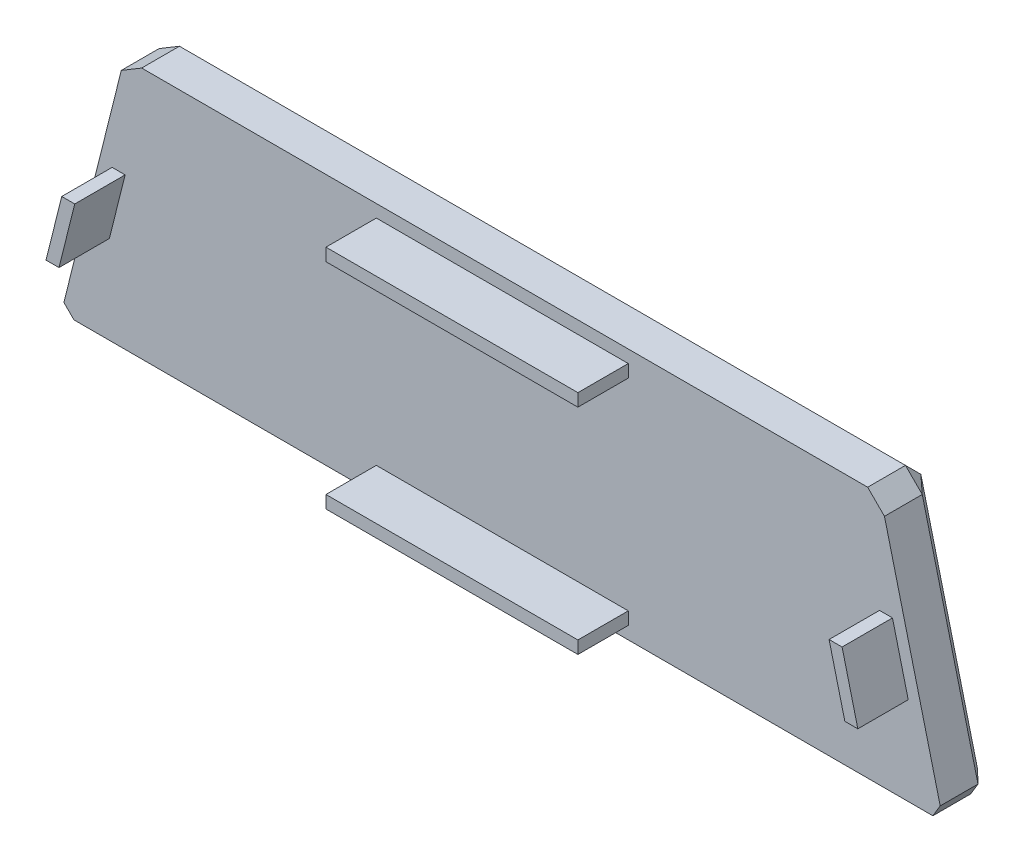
ISO-10303-21;
HEADER;
FILE_DESCRIPTION(('STEP AP214'),'2;1');
FILE_NAME('part.step','',(''),(''),'','','');
FILE_SCHEMA(('AUTOMOTIVE_DESIGN { 1 0 10303 214 1 1 1 1 }'));
ENDSEC;
DATA;
#1=APPLICATION_CONTEXT('core data for automotive mechanical design processes');
#2=APPLICATION_PROTOCOL_DEFINITION('international standard','automotive_design',2000,#1);
#3=PRODUCT_CONTEXT('',#1,'mechanical');
#4=PRODUCT('Part','Part','',(#3));
#5=PRODUCT_RELATED_PRODUCT_CATEGORY('part','',(#4));
#6=PRODUCT_DEFINITION_FORMATION('','',#4);
#7=PRODUCT_DEFINITION_CONTEXT('part definition',#1,'design');
#8=PRODUCT_DEFINITION('design','',#6,#7);
#9=PRODUCT_DEFINITION_SHAPE('','',#8);
#10=(LENGTH_UNIT() NAMED_UNIT(*) SI_UNIT(.MILLI.,.METRE.));
#11=(NAMED_UNIT(*) PLANE_ANGLE_UNIT() SI_UNIT($,.RADIAN.));
#12=(NAMED_UNIT(*) SI_UNIT($,.STERADIAN.) SOLID_ANGLE_UNIT());
#13=UNCERTAINTY_MEASURE_WITH_UNIT(LENGTH_MEASURE(1.E-05),#10,'distance_accuracy_value','');
#14=(GEOMETRIC_REPRESENTATION_CONTEXT(3) GLOBAL_UNCERTAINTY_ASSIGNED_CONTEXT((#13)) GLOBAL_UNIT_ASSIGNED_CONTEXT((#10,
#11,#12)) REPRESENTATION_CONTEXT('',''));
#15=CARTESIAN_POINT('',(0.,0.,0.));
#16=DIRECTION('',(0.,0.,1.));
#17=DIRECTION('',(1.,0.,0.));
#18=AXIS2_PLACEMENT_3D('',#15,#16,#17);
#19=CARTESIAN_POINT('',(0.,0.,0.));
#20=DIRECTION('',(0.,0.,1.));
#21=DIRECTION('',(1.,0.,0.));
#22=AXIS2_PLACEMENT_3D('',#19,#20,#21);
#23=PLANE('',#22);
#24=DIRECTION('',(-1.,0.,0.));
#25=VECTOR('',#24,1.);
#26=CARTESIAN_POINT('',(0.,11.,0.));
#27=LINE('',#26,#25);
#28=CARTESIAN_POINT('',(16.1096117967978,11.,0.));
#29=VERTEX_POINT('',#28);
#30=CARTESIAN_POINT('',(15.5942235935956,11.,0.));
#31=VERTEX_POINT('',#30);
#32=EDGE_CURVE('E219',#29,#31,#27,.T.);
#33=ORIENTED_EDGE('',*,*,#32,.T.);
#34=DIRECTION('',(-0.242535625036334,0.970142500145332,0.));
#35=VECTOR('',#34,1.);
#36=CARTESIAN_POINT('',(17.2651516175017,4.31628790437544,0.));
#37=LINE('',#36,#35);
#38=CARTESIAN_POINT('',(14.9692235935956,13.5,0.));
#39=VERTEX_POINT('',#38);
#40=EDGE_CURVE('E236',#31,#39,#37,.T.);
#41=ORIENTED_EDGE('',*,*,#40,.T.);
#42=DIRECTION('',(-1.,0.,0.));
#43=VECTOR('',#42,1.);
#44=CARTESIAN_POINT('',(0.,13.5,0.));
#45=LINE('',#44,#43);
#46=CARTESIAN_POINT('',(15.4846117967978,13.5,0.));
#47=VERTEX_POINT('',#46);
#48=EDGE_CURVE('E238',#47,#39,#45,.T.);
#49=ORIENTED_EDGE('',*,*,#48,.F.);
#50=DIRECTION('',(-0.242535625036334,0.970142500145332,0.));
#51=VECTOR('',#50,1.);
#52=CARTESIAN_POINT('',(17.7502228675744,4.43755571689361,0.));
#53=LINE('',#52,#51);
#54=EDGE_CURVE('E245',#29,#47,#53,.T.);
#55=ORIENTED_EDGE('',*,*,#54,.F.);
#56=EDGE_LOOP('',(#33,#41,#49,#55));
#57=FACE_BOUND('',#56,.T.);
#58=DIRECTION('',(0.242535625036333,-0.970142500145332,0.));
#59=VECTOR('',#58,1.);
#60=CARTESIAN_POINT('',(18.2352941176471,4.55882352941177,0.));
#61=LINE('',#60,#59);
#62=CARTESIAN_POINT('',(15.1666666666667,16.8333333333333,0.));
#63=VERTEX_POINT('',#62);
#64=CARTESIAN_POINT('',(17.3787321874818,7.98507125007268,0.));
#65=VERTEX_POINT('',#64);
#66=EDGE_CURVE('E350',#63,#65,#61,.T.);
#67=ORIENTED_EDGE('',*,*,#66,.F.);
#68=DIRECTION('',(0.707106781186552,-0.707106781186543,0.));
#69=VECTOR('',#68,1.);
#70=CARTESIAN_POINT('',(15.9999999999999,16.0000000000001,0.));
#71=LINE('',#70,#69);
#72=CARTESIAN_POINT('',(14.5,17.5,0.));
#73=VERTEX_POINT('',#72);
#74=EDGE_CURVE('E11',#63,#73,#71,.F.);
#75=ORIENTED_EDGE('',*,*,#74,.T.);
#76=DIRECTION('',(1.,0.,0.));
#77=VECTOR('',#76,1.);
#78=CARTESIAN_POINT('',(0.,17.5,0.));
#79=LINE('',#78,#77);
#80=CARTESIAN_POINT('',(-14.3128157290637,17.5,0.));
#81=VERTEX_POINT('',#80);
#82=EDGE_CURVE('E353',#81,#73,#79,.T.);
#83=ORIENTED_EDGE('',*,*,#82,.F.);
#84=DIRECTION('',(0.857492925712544,0.514495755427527,0.));
#85=VECTOR('',#84,1.);
#86=CARTESIAN_POINT('',(-11.509274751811,19.1821245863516,0.));
#87=LINE('',#86,#85);
#88=CARTESIAN_POINT('',(-15.1212678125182,17.0149287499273,0.));
#89=VERTEX_POINT('',#88);
#90=EDGE_CURVE('E388',#81,#89,#87,.F.);
#91=ORIENTED_EDGE('',*,*,#90,.T.);
#92=DIRECTION('',(0.242535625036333,0.970142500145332,0.));
#93=VECTOR('',#92,1.);
#94=CARTESIAN_POINT('',(-18.2352941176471,4.55882352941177,0.));
#95=LINE('',#94,#93);
#96=CARTESIAN_POINT('',(-17.4,7.89999999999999,0.));
#97=VERTEX_POINT('',#96);
#98=EDGE_CURVE('E345',#97,#89,#95,.T.);
#99=ORIENTED_EDGE('',*,*,#98,.F.);
#100=DIRECTION('',(0.707106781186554,-0.707106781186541,0.));
#101=VECTOR('',#100,1.);
#102=CARTESIAN_POINT('',(-4.74999999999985,-4.74999999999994,0.));
#103=LINE('',#102,#101);
#104=CARTESIAN_POINT('',(-17.,7.5,0.));
#105=VERTEX_POINT('',#104);
#106=EDGE_CURVE('E390',#97,#105,#103,.T.);
#107=ORIENTED_EDGE('',*,*,#106,.T.);
#108=DIRECTION('',(1.,0.,0.));
#109=VECTOR('',#108,1.);
#110=CARTESIAN_POINT('',(0.,7.5,0.));
#111=LINE('',#110,#109);
#112=CARTESIAN_POINT('',(17.0876894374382,7.5,0.));
#113=VERTEX_POINT('',#112);
#114=EDGE_CURVE('E347',#105,#113,#111,.T.);
#115=ORIENTED_EDGE('',*,*,#114,.T.);
#116=DIRECTION('',(0.514495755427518,0.85749292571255,0.));
#117=VECTOR('',#116,1.);
#118=CARTESIAN_POINT('',(9.25565399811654,-5.55339239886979,0.));
#119=LINE('',#118,#117);
#120=EDGE_CURVE('E46',#113,#65,#119,.T.);
#121=ORIENTED_EDGE('',*,*,#120,.T.);
#122=EDGE_LOOP('',(#67,#75,#83,#91,#99,#107,#115,#121));
#123=FACE_BOUND('',#122,.T.);
#124=DIRECTION('',(1.,0.,0.));
#125=VECTOR('',#124,1.);
#126=CARTESIAN_POINT('',(0.,13.5,0.));
#127=LINE('',#126,#125);
#128=CARTESIAN_POINT('',(-15.4846117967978,13.5,0.));
#129=VERTEX_POINT('',#128);
#130=CARTESIAN_POINT('',(-14.9692235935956,13.5,0.));
#131=VERTEX_POINT('',#130);
#132=EDGE_CURVE('E313',#129,#131,#127,.T.);
#133=ORIENTED_EDGE('',*,*,#132,.T.);
#134=DIRECTION('',(-0.242535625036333,-0.970142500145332,0.));
#135=VECTOR('',#134,1.);
#136=CARTESIAN_POINT('',(-17.2651516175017,4.31628790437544,0.));
#137=LINE('',#136,#135);
#138=CARTESIAN_POINT('',(-15.5942235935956,11.,0.));
#139=VERTEX_POINT('',#138);
#140=EDGE_CURVE('E318',#131,#139,#137,.T.);
#141=ORIENTED_EDGE('',*,*,#140,.T.);
#142=DIRECTION('',(1.,0.,0.));
#143=VECTOR('',#142,1.);
#144=CARTESIAN_POINT('',(0.,11.,0.));
#145=LINE('',#144,#143);
#146=CARTESIAN_POINT('',(-16.1096117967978,11.,0.));
#147=VERTEX_POINT('',#146);
#148=EDGE_CURVE('E330',#147,#139,#145,.T.);
#149=ORIENTED_EDGE('',*,*,#148,.F.);
#150=DIRECTION('',(-0.242535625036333,-0.970142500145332,0.));
#151=VECTOR('',#150,1.);
#152=CARTESIAN_POINT('',(-17.7502228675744,4.4375557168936,0.));
#153=LINE('',#152,#151);
#154=EDGE_CURVE('E327',#129,#147,#153,.T.);
#155=ORIENTED_EDGE('',*,*,#154,.F.);
#156=EDGE_LOOP('',(#133,#141,#149,#155));
#157=FACE_BOUND('',#156,.T.);
#158=DIRECTION('',(-1.,0.,0.));
#159=VECTOR('',#158,1.);
#160=CARTESIAN_POINT('',(0.,16.5,0.));
#161=LINE('',#160,#159);
#162=CARTESIAN_POINT('',(5.,16.5,0.));
#163=VERTEX_POINT('',#162);
#164=CARTESIAN_POINT('',(-5.,16.5,0.));
#165=VERTEX_POINT('',#164);
#166=EDGE_CURVE('E284',#163,#165,#161,.T.);
#167=ORIENTED_EDGE('',*,*,#166,.T.);
#168=DIRECTION('',(0.,-1.,0.));
#169=VECTOR('',#168,1.);
#170=CARTESIAN_POINT('',(-5.,0.,0.));
#171=LINE('',#170,#169);
#172=CARTESIAN_POINT('',(-5.,17.,0.));
#173=VERTEX_POINT('',#172);
#174=EDGE_CURVE('E289',#173,#165,#171,.T.);
#175=ORIENTED_EDGE('',*,*,#174,.F.);
#176=DIRECTION('',(-1.,0.,0.));
#177=VECTOR('',#176,1.);
#178=CARTESIAN_POINT('',(0.,17.,0.));
#179=LINE('',#178,#177);
#180=CARTESIAN_POINT('',(5.,17.,0.));
#181=VERTEX_POINT('',#180);
#182=EDGE_CURVE('E300',#181,#173,#179,.T.);
#183=ORIENTED_EDGE('',*,*,#182,.F.);
#184=DIRECTION('',(0.,1.,0.));
#185=VECTOR('',#184,1.);
#186=CARTESIAN_POINT('',(5.,0.,0.));
#187=LINE('',#186,#185);
#188=EDGE_CURVE('E298',#163,#181,#187,.T.);
#189=ORIENTED_EDGE('',*,*,#188,.F.);
#190=EDGE_LOOP('',(#167,#175,#183,#189));
#191=FACE_BOUND('',#190,.T.);
#192=DIRECTION('',(0.,1.,0.));
#193=VECTOR('',#192,1.);
#194=CARTESIAN_POINT('',(5.,0.,0.));
#195=LINE('',#194,#193);
#196=CARTESIAN_POINT('',(5.,8.,0.));
#197=VERTEX_POINT('',#196);
#198=CARTESIAN_POINT('',(5.,8.5,0.));
#199=VERTEX_POINT('',#198);
#200=EDGE_CURVE('E268',#197,#199,#195,.T.);
#201=ORIENTED_EDGE('',*,*,#200,.F.);
#202=DIRECTION('',(1.,0.,0.));
#203=VECTOR('',#202,1.);
#204=CARTESIAN_POINT('',(0.,8.,0.));
#205=LINE('',#204,#203);
#206=CARTESIAN_POINT('',(-5.,8.,0.));
#207=VERTEX_POINT('',#206);
#208=EDGE_CURVE('E222',#207,#197,#205,.T.);
#209=ORIENTED_EDGE('',*,*,#208,.F.);
#210=DIRECTION('',(0.,-1.,0.));
#211=VECTOR('',#210,1.);
#212=CARTESIAN_POINT('',(-5.,0.,0.));
#213=LINE('',#212,#211);
#214=CARTESIAN_POINT('',(-5.,8.5,0.));
#215=VERTEX_POINT('',#214);
#216=EDGE_CURVE('E258',#215,#207,#213,.T.);
#217=ORIENTED_EDGE('',*,*,#216,.F.);
#218=DIRECTION('',(1.,0.,0.));
#219=VECTOR('',#218,1.);
#220=CARTESIAN_POINT('',(0.,8.5,0.));
#221=LINE('',#220,#219);
#222=EDGE_CURVE('E271',#215,#199,#221,.T.);
#223=ORIENTED_EDGE('',*,*,#222,.T.);
#224=EDGE_LOOP('',(#201,#209,#217,#223));
#225=FACE_BOUND('',#224,.T.);
#226=ADVANCED_FACE('F37',(#57,#123,#157,#191,#225),#23,.T.);
#227=CARTESIAN_POINT('',(-18.2352941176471,4.55882352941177,-2.));
#228=DIRECTION('',(0.970142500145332,-0.242535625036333,0.));
#229=DIRECTION('',(0.242535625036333,0.970142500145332,0.));
#230=AXIS2_PLACEMENT_3D('',#227,#228,#229);
#231=PLANE('',#230);
#232=DIRECTION('',(-0.242535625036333,-0.970142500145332,0.));
#233=VECTOR('',#232,1.);
#234=CARTESIAN_POINT('',(-18.2352941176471,4.55882352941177,-1.5));
#235=LINE('',#234,#233);
#236=CARTESIAN_POINT('',(-15.1212678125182,17.0149287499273,-1.5));
#237=VERTEX_POINT('',#236);
#238=CARTESIAN_POINT('',(-17.4,7.89999999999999,-1.5));
#239=VERTEX_POINT('',#238);
#240=EDGE_CURVE('E54',#237,#239,#235,.T.);
#241=ORIENTED_EDGE('',*,*,#240,.T.);
#242=DIRECTION('',(0.,0.,1.));
#243=VECTOR('',#242,1.);
#244=CARTESIAN_POINT('',(-17.4,7.89999999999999,0.));
#245=LINE('',#244,#243);
#246=EDGE_CURVE('E386',#239,#97,#245,.T.);
#247=ORIENTED_EDGE('',*,*,#246,.T.);
#248=ORIENTED_EDGE('',*,*,#98,.T.);
#249=DIRECTION('',(0.,0.,-1.));
#250=VECTOR('',#249,1.);
#251=CARTESIAN_POINT('',(-15.1212678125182,17.0149287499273,-2.));
#252=LINE('',#251,#250);
#253=EDGE_CURVE('E59',#89,#237,#252,.T.);
#254=ORIENTED_EDGE('',*,*,#253,.T.);
#255=EDGE_LOOP('',(#241,#247,#248,#254));
#256=FACE_BOUND('',#255,.T.);
#257=ADVANCED_FACE('F444',(#256),#231,.F.);
#258=CARTESIAN_POINT('',(0.,17.5,-2.));
#259=DIRECTION('',(0.,-1.,0.));
#260=DIRECTION('',(0.,0.,-1.));
#261=AXIS2_PLACEMENT_3D('',#258,#259,#260);
#262=PLANE('',#261);
#263=ORIENTED_EDGE('',*,*,#82,.T.);
#264=DIRECTION('',(0.,0.,-1.));
#265=VECTOR('',#264,1.);
#266=CARTESIAN_POINT('',(14.5,17.5,-2.));
#267=LINE('',#266,#265);
#268=CARTESIAN_POINT('',(14.5,17.5,-1.5));
#269=VERTEX_POINT('',#268);
#270=EDGE_CURVE('E382',#73,#269,#267,.T.);
#271=ORIENTED_EDGE('',*,*,#270,.T.);
#272=DIRECTION('',(-1.,0.,0.));
#273=VECTOR('',#272,1.);
#274=CARTESIAN_POINT('',(0.,17.5,-1.5));
#275=LINE('',#274,#273);
#276=CARTESIAN_POINT('',(-14.3128157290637,17.5,-1.5));
#277=VERTEX_POINT('',#276);
#278=EDGE_CURVE('E380',#269,#277,#275,.T.);
#279=ORIENTED_EDGE('',*,*,#278,.T.);
#280=DIRECTION('',(0.,0.,1.));
#281=VECTOR('',#280,1.);
#282=CARTESIAN_POINT('',(-14.3128157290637,17.5,-2.));
#283=LINE('',#282,#281);
#284=EDGE_CURVE('E378',#277,#81,#283,.T.);
#285=ORIENTED_EDGE('',*,*,#284,.T.);
#286=EDGE_LOOP('',(#263,#271,#279,#285));
#287=FACE_BOUND('',#286,.T.);
#288=ADVANCED_FACE('F454',(#287),#262,.F.);
#289=CARTESIAN_POINT('',(18.2352941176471,4.55882352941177,-2.));
#290=DIRECTION('',(-0.970142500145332,-0.242535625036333,0.));
#291=DIRECTION('',(0.242535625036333,-0.970142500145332,0.));
#292=AXIS2_PLACEMENT_3D('',#289,#290,#291);
#293=PLANE('',#292);
#294=DIRECTION('',(-0.242535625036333,0.970142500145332,0.));
#295=VECTOR('',#294,1.);
#296=CARTESIAN_POINT('',(18.2352941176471,4.55882352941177,-1.5));
#297=LINE('',#296,#295);
#298=CARTESIAN_POINT('',(17.3787321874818,7.98507125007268,-1.5));
#299=VERTEX_POINT('',#298);
#300=CARTESIAN_POINT('',(15.1666666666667,16.8333333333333,-1.5));
#301=VERTEX_POINT('',#300);
#302=EDGE_CURVE('E374',#299,#301,#297,.T.);
#303=ORIENTED_EDGE('',*,*,#302,.T.);
#304=DIRECTION('',(0.,0.,1.));
#305=VECTOR('',#304,1.);
#306=CARTESIAN_POINT('',(15.1666666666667,16.8333333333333,-2.));
#307=LINE('',#306,#305);
#308=EDGE_CURVE('E376',#301,#63,#307,.T.);
#309=ORIENTED_EDGE('',*,*,#308,.T.);
#310=ORIENTED_EDGE('',*,*,#66,.T.);
#311=DIRECTION('',(0.,0.,-1.));
#312=VECTOR('',#311,1.);
#313=CARTESIAN_POINT('',(17.3787321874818,7.98507125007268,-2.));
#314=LINE('',#313,#312);
#315=EDGE_CURVE('E372',#65,#299,#314,.T.);
#316=ORIENTED_EDGE('',*,*,#315,.T.);
#317=EDGE_LOOP('',(#303,#309,#310,#316));
#318=FACE_BOUND('',#317,.T.);
#319=ADVANCED_FACE('F488',(#318),#293,.F.);
#320=CARTESIAN_POINT('',(0.,7.5,-2.));
#321=DIRECTION('',(0.,-1.,0.));
#322=DIRECTION('',(0.,0.,-1.));
#323=AXIS2_PLACEMENT_3D('',#320,#321,#322);
#324=PLANE('',#323);
#325=DIRECTION('',(1.,0.,0.));
#326=VECTOR('',#325,1.);
#327=CARTESIAN_POINT('',(17.5,7.5,-1.5));
#328=LINE('',#327,#326);
#329=CARTESIAN_POINT('',(-17.,7.5,-1.5));
#330=VERTEX_POINT('',#329);
#331=CARTESIAN_POINT('',(17.0876894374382,7.5,-1.5));
#332=VERTEX_POINT('',#331);
#333=EDGE_CURVE('E358',#330,#332,#328,.T.);
#334=ORIENTED_EDGE('',*,*,#333,.T.);
#335=DIRECTION('',(0.,0.,1.));
#336=VECTOR('',#335,1.);
#337=CARTESIAN_POINT('',(17.0876894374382,7.5,0.));
#338=LINE('',#337,#336);
#339=EDGE_CURVE('E361',#332,#113,#338,.T.);
#340=ORIENTED_EDGE('',*,*,#339,.T.);
#341=ORIENTED_EDGE('',*,*,#114,.F.);
#342=DIRECTION('',(0.,0.,-1.));
#343=VECTOR('',#342,1.);
#344=CARTESIAN_POINT('',(-17.,7.5,-2.));
#345=LINE('',#344,#343);
#346=EDGE_CURVE('E356',#105,#330,#345,.T.);
#347=ORIENTED_EDGE('',*,*,#346,.T.);
#348=EDGE_LOOP('',(#334,#340,#341,#347));
#349=FACE_BOUND('',#348,.T.);
#350=ADVANCED_FACE('F486',(#349),#324,.T.);
#351=CARTESIAN_POINT('',(0.,0.,-2.));
#352=DIRECTION('',(0.,0.,1.));
#353=DIRECTION('',(1.,0.,0.));
#354=AXIS2_PLACEMENT_3D('',#351,#352,#353);
#355=PLANE('',#354);
#356=DIRECTION('',(0.242535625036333,-0.970142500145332,0.));
#357=VECTOR('',#356,1.);
#358=CARTESIAN_POINT('',(17.7502228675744,4.4375557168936,-2.));
#359=LINE('',#358,#357);
#360=CARTESIAN_POINT('',(14.6096117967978,17.,-2.));
#361=VERTEX_POINT('',#360);
#362=CARTESIAN_POINT('',(16.8596117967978,8.,-2.));
#363=VERTEX_POINT('',#362);
#364=EDGE_CURVE('E367',#361,#363,#359,.T.);
#365=ORIENTED_EDGE('',*,*,#364,.T.);
#366=DIRECTION('',(-1.,0.,0.));
#367=VECTOR('',#366,1.);
#368=CARTESIAN_POINT('',(-17.5,8.,-2.));
#369=LINE('',#368,#367);
#370=CARTESIAN_POINT('',(-16.8596117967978,8.,-2.));
#371=VERTEX_POINT('',#370);
#372=EDGE_CURVE('E369',#363,#371,#369,.T.);
#373=ORIENTED_EDGE('',*,*,#372,.T.);
#374=DIRECTION('',(0.242535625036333,0.970142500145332,0.));
#375=VECTOR('',#374,1.);
#376=CARTESIAN_POINT('',(-17.7502228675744,4.4375557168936,-2.));
#377=LINE('',#376,#375);
#378=CARTESIAN_POINT('',(-14.6096117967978,17.,-2.));
#379=VERTEX_POINT('',#378);
#380=EDGE_CURVE('E363',#371,#379,#377,.T.);
#381=ORIENTED_EDGE('',*,*,#380,.T.);
#382=DIRECTION('',(1.,0.,0.));
#383=VECTOR('',#382,1.);
#384=CARTESIAN_POINT('',(0.,17.,-2.));
#385=LINE('',#384,#383);
#386=EDGE_CURVE('E365',#379,#361,#385,.T.);
#387=ORIENTED_EDGE('',*,*,#386,.T.);
#388=EDGE_LOOP('',(#365,#373,#381,#387));
#389=FACE_BOUND('',#388,.T.);
#390=ADVANCED_FACE('F473',(#389),#355,.F.);
#391=CARTESIAN_POINT('',(0.,13.5,2.));
#392=DIRECTION('',(0.,1.,0.));
#393=DIRECTION('',(0.,0.,1.));
#394=AXIS2_PLACEMENT_3D('',#391,#392,#393);
#395=PLANE('',#394);
#396=ORIENTED_EDGE('',*,*,#132,.F.);
#397=DIRECTION('',(0.,0.,-1.));
#398=VECTOR('',#397,1.);
#399=CARTESIAN_POINT('',(-15.4846117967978,13.5,2.));
#400=LINE('',#399,#398);
#401=CARTESIAN_POINT('',(-15.4846117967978,13.5,2.));
#402=VERTEX_POINT('',#401);
#403=EDGE_CURVE('E342',#402,#129,#400,.T.);
#404=ORIENTED_EDGE('',*,*,#403,.F.);
#405=DIRECTION('',(1.,0.,0.));
#406=VECTOR('',#405,1.);
#407=CARTESIAN_POINT('',(0.,13.5,2.));
#408=LINE('',#407,#406);
#409=CARTESIAN_POINT('',(-14.9692235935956,13.5,2.));
#410=VERTEX_POINT('',#409);
#411=EDGE_CURVE('E314',#402,#410,#408,.T.);
#412=ORIENTED_EDGE('',*,*,#411,.T.);
#413=DIRECTION('',(0.,0.,-1.));
#414=VECTOR('',#413,1.);
#415=CARTESIAN_POINT('',(-14.9692235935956,13.5,2.));
#416=LINE('',#415,#414);
#417=EDGE_CURVE('E325',#410,#131,#416,.T.);
#418=ORIENTED_EDGE('',*,*,#417,.T.);
#419=EDGE_LOOP('',(#396,#404,#412,#418));
#420=FACE_BOUND('',#419,.T.);
#421=ADVANCED_FACE('F507',(#420),#395,.T.);
#422=CARTESIAN_POINT('',(-17.7502228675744,4.4375557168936,2.));
#423=DIRECTION('',(0.970142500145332,-0.242535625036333,0.));
#424=DIRECTION('',(0.242535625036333,0.970142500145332,0.));
#425=AXIS2_PLACEMENT_3D('',#422,#423,#424);
#426=PLANE('',#425);
#427=ORIENTED_EDGE('',*,*,#154,.T.);
#428=DIRECTION('',(0.,0.,-1.));
#429=VECTOR('',#428,1.);
#430=CARTESIAN_POINT('',(-16.1096117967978,11.,2.));
#431=LINE('',#430,#429);
#432=CARTESIAN_POINT('',(-16.1096117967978,11.,2.));
#433=VERTEX_POINT('',#432);
#434=EDGE_CURVE('E339',#433,#147,#431,.T.);
#435=ORIENTED_EDGE('',*,*,#434,.F.);
#436=DIRECTION('',(-0.242535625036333,-0.970142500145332,0.));
#437=VECTOR('',#436,1.);
#438=CARTESIAN_POINT('',(-17.7502228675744,4.4375557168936,2.));
#439=LINE('',#438,#437);
#440=EDGE_CURVE('E317',#402,#433,#439,.T.);
#441=ORIENTED_EDGE('',*,*,#440,.F.);
#442=ORIENTED_EDGE('',*,*,#403,.T.);
#443=EDGE_LOOP('',(#427,#435,#441,#442));
#444=FACE_BOUND('',#443,.T.);
#445=ADVANCED_FACE('F510',(#444),#426,.F.);
#446=CARTESIAN_POINT('',(0.,11.,2.));
#447=DIRECTION('',(0.,1.,0.));
#448=DIRECTION('',(0.,0.,1.));
#449=AXIS2_PLACEMENT_3D('',#446,#447,#448);
#450=PLANE('',#449);
#451=ORIENTED_EDGE('',*,*,#148,.T.);
#452=DIRECTION('',(0.,0.,-1.));
#453=VECTOR('',#452,1.);
#454=CARTESIAN_POINT('',(-15.5942235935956,11.,2.));
#455=LINE('',#454,#453);
#456=CARTESIAN_POINT('',(-15.5942235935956,11.,2.));
#457=VERTEX_POINT('',#456);
#458=EDGE_CURVE('E336',#457,#139,#455,.T.);
#459=ORIENTED_EDGE('',*,*,#458,.F.);
#460=DIRECTION('',(1.,0.,0.));
#461=VECTOR('',#460,1.);
#462=CARTESIAN_POINT('',(0.,11.,2.));
#463=LINE('',#462,#461);
#464=EDGE_CURVE('E320',#433,#457,#463,.T.);
#465=ORIENTED_EDGE('',*,*,#464,.F.);
#466=ORIENTED_EDGE('',*,*,#434,.T.);
#467=EDGE_LOOP('',(#451,#459,#465,#466));
#468=FACE_BOUND('',#467,.T.);
#469=ADVANCED_FACE('F514',(#468),#450,.F.);
#470=CARTESIAN_POINT('',(-17.2651516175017,4.31628790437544,2.));
#471=DIRECTION('',(0.970142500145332,-0.242535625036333,0.));
#472=DIRECTION('',(0.242535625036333,0.970142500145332,0.));
#473=AXIS2_PLACEMENT_3D('',#470,#471,#472);
#474=PLANE('',#473);
#475=ORIENTED_EDGE('',*,*,#140,.F.);
#476=ORIENTED_EDGE('',*,*,#417,.F.);
#477=DIRECTION('',(-0.242535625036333,-0.970142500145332,0.));
#478=VECTOR('',#477,1.);
#479=CARTESIAN_POINT('',(-17.2651516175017,4.31628790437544,2.));
#480=LINE('',#479,#478);
#481=EDGE_CURVE('E322',#410,#457,#480,.T.);
#482=ORIENTED_EDGE('',*,*,#481,.T.);
#483=ORIENTED_EDGE('',*,*,#458,.T.);
#484=EDGE_LOOP('',(#475,#476,#482,#483));
#485=FACE_BOUND('',#484,.T.);
#486=ADVANCED_FACE('F518',(#485),#474,.T.);
#487=CARTESIAN_POINT('',(0.,0.,2.));
#488=DIRECTION('',(0.,0.,1.));
#489=DIRECTION('',(1.,0.,0.));
#490=AXIS2_PLACEMENT_3D('',#487,#488,#489);
#491=PLANE('',#490);
#492=ORIENTED_EDGE('',*,*,#411,.F.);
#493=ORIENTED_EDGE('',*,*,#440,.T.);
#494=ORIENTED_EDGE('',*,*,#464,.T.);
#495=ORIENTED_EDGE('',*,*,#481,.F.);
#496=EDGE_LOOP('',(#492,#493,#494,#495));
#497=FACE_BOUND('',#496,.T.);
#498=ADVANCED_FACE('F522',(#497),#491,.T.);
#499=CARTESIAN_POINT('',(0.,16.5,2.));
#500=DIRECTION('',(0.,-1.,0.));
#501=DIRECTION('',(1.,0.,0.));
#502=AXIS2_PLACEMENT_3D('',#499,#500,#501);
#503=PLANE('',#502);
#504=ORIENTED_EDGE('',*,*,#166,.F.);
#505=DIRECTION('',(0.,0.,-1.));
#506=VECTOR('',#505,1.);
#507=CARTESIAN_POINT('',(5.,16.5,2.));
#508=LINE('',#507,#506);
#509=CARTESIAN_POINT('',(5.,16.5,2.));
#510=VERTEX_POINT('',#509);
#511=EDGE_CURVE('E311',#510,#163,#508,.T.);
#512=ORIENTED_EDGE('',*,*,#511,.F.);
#513=DIRECTION('',(-1.,0.,0.));
#514=VECTOR('',#513,1.);
#515=CARTESIAN_POINT('',(0.,16.5,2.));
#516=LINE('',#515,#514);
#517=CARTESIAN_POINT('',(-5.,16.5,2.));
#518=VERTEX_POINT('',#517);
#519=EDGE_CURVE('E285',#510,#518,#516,.T.);
#520=ORIENTED_EDGE('',*,*,#519,.T.);
#521=DIRECTION('',(0.,0.,-1.));
#522=VECTOR('',#521,1.);
#523=CARTESIAN_POINT('',(-5.,16.5,2.));
#524=LINE('',#523,#522);
#525=EDGE_CURVE('E295',#518,#165,#524,.T.);
#526=ORIENTED_EDGE('',*,*,#525,.T.);
#527=EDGE_LOOP('',(#504,#512,#520,#526));
#528=FACE_BOUND('',#527,.T.);
#529=ADVANCED_FACE('F526',(#528),#503,.T.);
#530=CARTESIAN_POINT('',(5.,0.,2.));
#531=DIRECTION('',(-1.,0.,0.));
#532=DIRECTION('',(0.,0.,1.));
#533=AXIS2_PLACEMENT_3D('',#530,#531,#532);
#534=PLANE('',#533);
#535=ORIENTED_EDGE('',*,*,#188,.T.);
#536=DIRECTION('',(0.,0.,-1.));
#537=VECTOR('',#536,1.);
#538=CARTESIAN_POINT('',(5.,17.,2.));
#539=LINE('',#538,#537);
#540=CARTESIAN_POINT('',(5.,17.,2.));
#541=VERTEX_POINT('',#540);
#542=EDGE_CURVE('E308',#541,#181,#539,.T.);
#543=ORIENTED_EDGE('',*,*,#542,.F.);
#544=DIRECTION('',(0.,1.,0.));
#545=VECTOR('',#544,1.);
#546=CARTESIAN_POINT('',(5.,0.,2.));
#547=LINE('',#546,#545);
#548=EDGE_CURVE('E288',#510,#541,#547,.T.);
#549=ORIENTED_EDGE('',*,*,#548,.F.);
#550=ORIENTED_EDGE('',*,*,#511,.T.);
#551=EDGE_LOOP('',(#535,#543,#549,#550));
#552=FACE_BOUND('',#551,.T.);
#553=ADVANCED_FACE('F530',(#552),#534,.F.);
#554=CARTESIAN_POINT('',(0.,17.,2.));
#555=DIRECTION('',(0.,-1.,0.));
#556=DIRECTION('',(1.,0.,0.));
#557=AXIS2_PLACEMENT_3D('',#554,#555,#556);
#558=PLANE('',#557);
#559=ORIENTED_EDGE('',*,*,#182,.T.);
#560=DIRECTION('',(0.,0.,-1.));
#561=VECTOR('',#560,1.);
#562=CARTESIAN_POINT('',(-5.,17.,2.));
#563=LINE('',#562,#561);
#564=CARTESIAN_POINT('',(-5.,17.,2.));
#565=VERTEX_POINT('',#564);
#566=EDGE_CURVE('E306',#565,#173,#563,.T.);
#567=ORIENTED_EDGE('',*,*,#566,.F.);
#568=DIRECTION('',(-1.,0.,0.));
#569=VECTOR('',#568,1.);
#570=CARTESIAN_POINT('',(0.,17.,2.));
#571=LINE('',#570,#569);
#572=EDGE_CURVE('E291',#541,#565,#571,.T.);
#573=ORIENTED_EDGE('',*,*,#572,.F.);
#574=ORIENTED_EDGE('',*,*,#542,.T.);
#575=EDGE_LOOP('',(#559,#567,#573,#574));
#576=FACE_BOUND('',#575,.T.);
#577=ADVANCED_FACE('F534',(#576),#558,.F.);
#578=CARTESIAN_POINT('',(-5.,0.,2.));
#579=DIRECTION('',(1.,0.,0.));
#580=DIRECTION('',(0.,0.,-1.));
#581=AXIS2_PLACEMENT_3D('',#578,#579,#580);
#582=PLANE('',#581);
#583=ORIENTED_EDGE('',*,*,#174,.T.);
#584=ORIENTED_EDGE('',*,*,#525,.F.);
#585=DIRECTION('',(0.,-1.,0.));
#586=VECTOR('',#585,1.);
#587=CARTESIAN_POINT('',(-5.,0.,2.));
#588=LINE('',#587,#586);
#589=EDGE_CURVE('E293',#565,#518,#588,.T.);
#590=ORIENTED_EDGE('',*,*,#589,.F.);
#591=ORIENTED_EDGE('',*,*,#566,.T.);
#592=EDGE_LOOP('',(#583,#584,#590,#591));
#593=FACE_BOUND('',#592,.T.);
#594=ADVANCED_FACE('F538',(#593),#582,.F.);
#595=CARTESIAN_POINT('',(0.,0.,2.));
#596=DIRECTION('',(0.,0.,1.));
#597=DIRECTION('',(1.,0.,0.));
#598=AXIS2_PLACEMENT_3D('',#595,#596,#597);
#599=PLANE('',#598);
#600=ORIENTED_EDGE('',*,*,#519,.F.);
#601=ORIENTED_EDGE('',*,*,#548,.T.);
#602=ORIENTED_EDGE('',*,*,#572,.T.);
#603=ORIENTED_EDGE('',*,*,#589,.T.);
#604=EDGE_LOOP('',(#600,#601,#602,#603));
#605=FACE_BOUND('',#604,.T.);
#606=ADVANCED_FACE('F542',(#605),#599,.T.);
#607=CARTESIAN_POINT('',(0.,8.,2.));
#608=DIRECTION('',(0.,1.,0.));
#609=DIRECTION('',(0.,0.,1.));
#610=AXIS2_PLACEMENT_3D('',#607,#608,#609);
#611=PLANE('',#610);
#612=ORIENTED_EDGE('',*,*,#208,.T.);
#613=DIRECTION('',(0.,0.,-1.));
#614=VECTOR('',#613,1.);
#615=CARTESIAN_POINT('',(5.,8.,2.));
#616=LINE('',#615,#614);
#617=CARTESIAN_POINT('',(5.,8.,2.));
#618=VERTEX_POINT('',#617);
#619=EDGE_CURVE('E282',#618,#197,#616,.T.);
#620=ORIENTED_EDGE('',*,*,#619,.F.);
#621=DIRECTION('',(1.,0.,0.));
#622=VECTOR('',#621,1.);
#623=CARTESIAN_POINT('',(0.,8.,2.));
#624=LINE('',#623,#622);
#625=CARTESIAN_POINT('',(-5.,8.,2.));
#626=VERTEX_POINT('',#625);
#627=EDGE_CURVE('E254',#626,#618,#624,.T.);
#628=ORIENTED_EDGE('',*,*,#627,.F.);
#629=DIRECTION('',(0.,0.,-1.));
#630=VECTOR('',#629,1.);
#631=CARTESIAN_POINT('',(-5.,8.,2.));
#632=LINE('',#631,#630);
#633=EDGE_CURVE('E265',#626,#207,#632,.T.);
#634=ORIENTED_EDGE('',*,*,#633,.T.);
#635=EDGE_LOOP('',(#612,#620,#628,#634));
#636=FACE_BOUND('',#635,.T.);
#637=ADVANCED_FACE('F546',(#636),#611,.F.);
#638=CARTESIAN_POINT('',(5.,0.,2.));
#639=DIRECTION('',(-1.,0.,0.));
#640=DIRECTION('',(0.,0.,1.));
#641=AXIS2_PLACEMENT_3D('',#638,#639,#640);
#642=PLANE('',#641);
#643=ORIENTED_EDGE('',*,*,#200,.T.);
#644=DIRECTION('',(0.,0.,-1.));
#645=VECTOR('',#644,1.);
#646=CARTESIAN_POINT('',(5.,8.5,2.));
#647=LINE('',#646,#645);
#648=CARTESIAN_POINT('',(5.,8.5,2.));
#649=VERTEX_POINT('',#648);
#650=EDGE_CURVE('E280',#649,#199,#647,.T.);
#651=ORIENTED_EDGE('',*,*,#650,.F.);
#652=DIRECTION('',(0.,1.,0.));
#653=VECTOR('',#652,1.);
#654=CARTESIAN_POINT('',(5.,0.,2.));
#655=LINE('',#654,#653);
#656=EDGE_CURVE('E257',#618,#649,#655,.T.);
#657=ORIENTED_EDGE('',*,*,#656,.F.);
#658=ORIENTED_EDGE('',*,*,#619,.T.);
#659=EDGE_LOOP('',(#643,#651,#657,#658));
#660=FACE_BOUND('',#659,.T.);
#661=ADVANCED_FACE('F550',(#660),#642,.F.);
#662=CARTESIAN_POINT('',(0.,8.5,2.));
#663=DIRECTION('',(0.,1.,0.));
#664=DIRECTION('',(0.,0.,1.));
#665=AXIS2_PLACEMENT_3D('',#662,#663,#664);
#666=PLANE('',#665);
#667=ORIENTED_EDGE('',*,*,#222,.F.);
#668=DIRECTION('',(0.,0.,-1.));
#669=VECTOR('',#668,1.);
#670=CARTESIAN_POINT('',(-5.,8.5,2.));
#671=LINE('',#670,#669);
#672=CARTESIAN_POINT('',(-5.,8.5,2.));
#673=VERTEX_POINT('',#672);
#674=EDGE_CURVE('E277',#673,#215,#671,.T.);
#675=ORIENTED_EDGE('',*,*,#674,.F.);
#676=DIRECTION('',(1.,0.,0.));
#677=VECTOR('',#676,1.);
#678=CARTESIAN_POINT('',(0.,8.5,2.));
#679=LINE('',#678,#677);
#680=EDGE_CURVE('E260',#673,#649,#679,.T.);
#681=ORIENTED_EDGE('',*,*,#680,.T.);
#682=ORIENTED_EDGE('',*,*,#650,.T.);
#683=EDGE_LOOP('',(#667,#675,#681,#682));
#684=FACE_BOUND('',#683,.T.);
#685=ADVANCED_FACE('F554',(#684),#666,.T.);
#686=CARTESIAN_POINT('',(-5.,0.,2.));
#687=DIRECTION('',(1.,0.,0.));
#688=DIRECTION('',(0.,0.,-1.));
#689=AXIS2_PLACEMENT_3D('',#686,#687,#688);
#690=PLANE('',#689);
#691=ORIENTED_EDGE('',*,*,#216,.T.);
#692=ORIENTED_EDGE('',*,*,#633,.F.);
#693=DIRECTION('',(0.,-1.,0.));
#694=VECTOR('',#693,1.);
#695=CARTESIAN_POINT('',(-5.,0.,2.));
#696=LINE('',#695,#694);
#697=EDGE_CURVE('E263',#673,#626,#696,.T.);
#698=ORIENTED_EDGE('',*,*,#697,.F.);
#699=ORIENTED_EDGE('',*,*,#674,.T.);
#700=EDGE_LOOP('',(#691,#692,#698,#699));
#701=FACE_BOUND('',#700,.T.);
#702=ADVANCED_FACE('F558',(#701),#690,.F.);
#703=CARTESIAN_POINT('',(0.,0.,2.));
#704=DIRECTION('',(0.,0.,1.));
#705=DIRECTION('',(1.,0.,0.));
#706=AXIS2_PLACEMENT_3D('',#703,#704,#705);
#707=PLANE('',#706);
#708=ORIENTED_EDGE('',*,*,#627,.T.);
#709=ORIENTED_EDGE('',*,*,#656,.T.);
#710=ORIENTED_EDGE('',*,*,#680,.F.);
#711=ORIENTED_EDGE('',*,*,#697,.T.);
#712=EDGE_LOOP('',(#708,#709,#710,#711));
#713=FACE_BOUND('',#712,.T.);
#714=ADVANCED_FACE('F562',(#713),#707,.T.);
#715=CARTESIAN_POINT('',(0.,11.,2.));
#716=DIRECTION('',(0.,-1.,0.));
#717=DIRECTION('',(0.,0.,-1.));
#718=AXIS2_PLACEMENT_3D('',#715,#716,#717);
#719=PLANE('',#718);
#720=ORIENTED_EDGE('',*,*,#32,.F.);
#721=DIRECTION('',(0.,0.,-1.));
#722=VECTOR('',#721,1.);
#723=CARTESIAN_POINT('',(16.1096117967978,11.,2.));
#724=LINE('',#723,#722);
#725=CARTESIAN_POINT('',(16.1096117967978,11.,2.));
#726=VERTEX_POINT('',#725);
#727=EDGE_CURVE('E212',#726,#29,#724,.T.);
#728=ORIENTED_EDGE('',*,*,#727,.F.);
#729=DIRECTION('',(-1.,0.,0.));
#730=VECTOR('',#729,1.);
#731=CARTESIAN_POINT('',(0.,11.,2.));
#732=LINE('',#731,#730);
#733=CARTESIAN_POINT('',(15.5942235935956,11.,2.));
#734=VERTEX_POINT('',#733);
#735=EDGE_CURVE('E217',#726,#734,#732,.T.);
#736=ORIENTED_EDGE('',*,*,#735,.T.);
#737=DIRECTION('',(0.,0.,-1.));
#738=VECTOR('',#737,1.);
#739=CARTESIAN_POINT('',(15.5942235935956,11.,2.));
#740=LINE('',#739,#738);
#741=EDGE_CURVE('E243',#734,#31,#740,.T.);
#742=ORIENTED_EDGE('',*,*,#741,.T.);
#743=EDGE_LOOP('',(#720,#728,#736,#742));
#744=FACE_BOUND('',#743,.T.);
#745=ADVANCED_FACE('F214',(#744),#719,.T.);
#746=CARTESIAN_POINT('',(17.7502228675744,4.43755571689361,2.));
#747=DIRECTION('',(-0.970142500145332,-0.242535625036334,0.));
#748=DIRECTION('',(0.242535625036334,-0.970142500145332,0.));
#749=AXIS2_PLACEMENT_3D('',#746,#747,#748);
#750=PLANE('',#749);
#751=ORIENTED_EDGE('',*,*,#54,.T.);
#752=DIRECTION('',(0.,0.,-1.));
#753=VECTOR('',#752,1.);
#754=CARTESIAN_POINT('',(15.4846117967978,13.5,2.));
#755=LINE('',#754,#753);
#756=CARTESIAN_POINT('',(15.4846117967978,13.5,2.));
#757=VERTEX_POINT('',#756);
#758=EDGE_CURVE('E223',#757,#47,#755,.T.);
#759=ORIENTED_EDGE('',*,*,#758,.F.);
#760=DIRECTION('',(-0.242535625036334,0.970142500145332,0.));
#761=VECTOR('',#760,1.);
#762=CARTESIAN_POINT('',(17.7502228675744,4.43755571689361,2.));
#763=LINE('',#762,#761);
#764=EDGE_CURVE('E226',#726,#757,#763,.T.);
#765=ORIENTED_EDGE('',*,*,#764,.F.);
#766=ORIENTED_EDGE('',*,*,#727,.T.);
#767=EDGE_LOOP('',(#751,#759,#765,#766));
#768=FACE_BOUND('',#767,.T.);
#769=ADVANCED_FACE('F227',(#768),#750,.F.);
#770=CARTESIAN_POINT('',(0.,13.5,2.));
#771=DIRECTION('',(0.,-1.,0.));
#772=DIRECTION('',(0.,0.,-1.));
#773=AXIS2_PLACEMENT_3D('',#770,#771,#772);
#774=PLANE('',#773);
#775=ORIENTED_EDGE('',*,*,#48,.T.);
#776=DIRECTION('',(0.,0.,-1.));
#777=VECTOR('',#776,1.);
#778=CARTESIAN_POINT('',(14.9692235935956,13.5,2.));
#779=LINE('',#778,#777);
#780=CARTESIAN_POINT('',(14.9692235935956,13.5,2.));
#781=VERTEX_POINT('',#780);
#782=EDGE_CURVE('E250',#781,#39,#779,.T.);
#783=ORIENTED_EDGE('',*,*,#782,.F.);
#784=DIRECTION('',(-1.,0.,0.));
#785=VECTOR('',#784,1.);
#786=CARTESIAN_POINT('',(0.,13.5,2.));
#787=LINE('',#786,#785);
#788=EDGE_CURVE('E231',#757,#781,#787,.T.);
#789=ORIENTED_EDGE('',*,*,#788,.F.);
#790=ORIENTED_EDGE('',*,*,#758,.T.);
#791=EDGE_LOOP('',(#775,#783,#789,#790));
#792=FACE_BOUND('',#791,.T.);
#793=ADVANCED_FACE('F571',(#792),#774,.F.);
#794=CARTESIAN_POINT('',(17.2651516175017,4.31628790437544,2.));
#795=DIRECTION('',(-0.970142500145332,-0.242535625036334,0.));
#796=DIRECTION('',(0.242535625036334,-0.970142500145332,0.));
#797=AXIS2_PLACEMENT_3D('',#794,#795,#796);
#798=PLANE('',#797);
#799=ORIENTED_EDGE('',*,*,#40,.F.);
#800=ORIENTED_EDGE('',*,*,#741,.F.);
#801=DIRECTION('',(-0.242535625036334,0.970142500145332,0.));
#802=VECTOR('',#801,1.);
#803=CARTESIAN_POINT('',(17.2651516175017,4.31628790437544,2.));
#804=LINE('',#803,#802);
#805=EDGE_CURVE('E235',#734,#781,#804,.T.);
#806=ORIENTED_EDGE('',*,*,#805,.T.);
#807=ORIENTED_EDGE('',*,*,#782,.T.);
#808=EDGE_LOOP('',(#799,#800,#806,#807));
#809=FACE_BOUND('',#808,.T.);
#810=ADVANCED_FACE('F574',(#809),#798,.T.);
#811=CARTESIAN_POINT('',(0.,0.,2.));
#812=DIRECTION('',(0.,0.,1.));
#813=DIRECTION('',(1.,0.,0.));
#814=AXIS2_PLACEMENT_3D('',#811,#812,#813);
#815=PLANE('',#814);
#816=ORIENTED_EDGE('',*,*,#735,.F.);
#817=ORIENTED_EDGE('',*,*,#764,.T.);
#818=ORIENTED_EDGE('',*,*,#788,.T.);
#819=ORIENTED_EDGE('',*,*,#805,.F.);
#820=EDGE_LOOP('',(#816,#817,#818,#819));
#821=FACE_BOUND('',#820,.T.);
#822=ADVANCED_FACE('F233',(#821),#815,.T.);
#823=CARTESIAN_POINT('',(-14.3128157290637,17.5,-2.));
#824=DIRECTION('',(0.514495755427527,-0.857492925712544,0.));
#825=DIRECTION('',(0.,0.,1.));
#826=AXIS2_PLACEMENT_3D('',#823,#824,#825);
#827=PLANE('',#826);
#828=ORIENTED_EDGE('',*,*,#90,.F.);
#829=ORIENTED_EDGE('',*,*,#284,.F.);
#830=DIRECTION('',(-0.857492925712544,-0.514495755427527,0.));
#831=VECTOR('',#830,1.);
#832=CARTESIAN_POINT('',(-14.3128157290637,17.5,-1.5));
#833=LINE('',#832,#831);
#834=EDGE_CURVE('E420',#237,#277,#833,.F.);
#835=ORIENTED_EDGE('',*,*,#834,.F.);
#836=ORIENTED_EDGE('',*,*,#253,.F.);
#837=EDGE_LOOP('',(#828,#829,#835,#836));
#838=FACE_BOUND('',#837,.T.);
#839=ADVANCED_FACE('F39',(#838),#827,.F.);
#840=CARTESIAN_POINT('',(15.1666666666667,16.8333333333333,-2.));
#841=DIRECTION('',(-0.707106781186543,-0.707106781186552,0.));
#842=DIRECTION('',(0.,0.,1.));
#843=AXIS2_PLACEMENT_3D('',#840,#841,#842);
#844=PLANE('',#843);
#845=ORIENTED_EDGE('',*,*,#74,.F.);
#846=ORIENTED_EDGE('',*,*,#308,.F.);
#847=DIRECTION('',(-0.707106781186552,0.707106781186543,0.));
#848=VECTOR('',#847,1.);
#849=CARTESIAN_POINT('',(15.1666666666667,16.8333333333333,-1.5));
#850=LINE('',#849,#848);
#851=EDGE_CURVE('E418',#269,#301,#850,.F.);
#852=ORIENTED_EDGE('',*,*,#851,.F.);
#853=ORIENTED_EDGE('',*,*,#270,.F.);
#854=EDGE_LOOP('',(#845,#846,#852,#853));
#855=FACE_BOUND('',#854,.T.);
#856=ADVANCED_FACE('F463',(#855),#844,.F.);
#857=CARTESIAN_POINT('',(0.,17.,-2.));
#858=DIRECTION('',(0.,-0.707106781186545,0.70710678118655));
#859=DIRECTION('',(1.,0.,0.));
#860=AXIS2_PLACEMENT_3D('',#857,#858,#859);
#861=PLANE('',#860);
#862=DIRECTION('',(0.387023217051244,0.652001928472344,0.65200192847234));
#863=VECTOR('',#862,1.);
#864=CARTESIAN_POINT('',(-14.3128157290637,17.5,-1.5));
#865=LINE('',#864,#863);
#866=EDGE_CURVE('E41',#277,#379,#865,.F.);
#867=ORIENTED_EDGE('',*,*,#866,.F.);
#868=ORIENTED_EDGE('',*,*,#278,.F.);
#869=DIRECTION('',(0.15318493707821,-0.698761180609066,-0.698761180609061));
#870=VECTOR('',#869,1.);
#871=CARTESIAN_POINT('',(14.5870035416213,17.103128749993,-1.89687125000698));
#872=LINE('',#871,#870);
#873=EDGE_CURVE('E415',#361,#269,#872,.F.);
#874=ORIENTED_EDGE('',*,*,#873,.F.);
#875=ORIENTED_EDGE('',*,*,#386,.F.);
#876=EDGE_LOOP('',(#867,#868,#874,#875));
#877=FACE_BOUND('',#876,.T.);
#878=ADVANCED_FACE('F458',(#877),#861,.F.);
#879=CARTESIAN_POINT('',(-14.3128157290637,17.5,-1.5));
#880=DIRECTION('',(-0.45041084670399,0.750684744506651,-0.483324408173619));
#881=DIRECTION('',(0.,0.541345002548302,0.840800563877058));
#882=AXIS2_PLACEMENT_3D('',#879,#880,#881);
#883=PLANE('',#882);
#884=ORIENTED_EDGE('',*,*,#834,.T.);
#885=ORIENTED_EDGE('',*,*,#866,.T.);
#886=DIRECTION('',(0.715050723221,-0.0208632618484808,-0.69876118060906));
#887=VECTOR('',#886,1.);
#888=CARTESIAN_POINT('',(-14.7151446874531,17.0030791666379,-1.89687125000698));
#889=LINE('',#888,#887);
#890=EDGE_CURVE('E412',#237,#379,#889,.T.);
#891=ORIENTED_EDGE('',*,*,#890,.F.);
#892=EDGE_LOOP('',(#884,#885,#891));
#893=FACE_BOUND('',#892,.T.);
#894=ADVANCED_FACE('F426',(#893),#883,.T.);
#895=CARTESIAN_POINT('',(15.1666666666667,16.8333333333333,-1.5));
#896=DIRECTION('',(0.619030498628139,0.619030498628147,-0.483324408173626));
#897=DIRECTION('',(-0.707106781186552,0.707106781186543,0.));
#898=AXIS2_PLACEMENT_3D('',#895,#896,#897);
#899=PLANE('',#898);
#900=ORIENTED_EDGE('',*,*,#873,.T.);
#901=ORIENTED_EDGE('',*,*,#851,.T.);
#902=DIRECTION('',(0.726401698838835,-0.217333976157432,0.652001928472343));
#903=VECTOR('',#902,1.);
#904=CARTESIAN_POINT('',(15.1666666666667,16.8333333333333,-1.5));
#905=LINE('',#904,#903);
#906=EDGE_CURVE('E409',#361,#301,#905,.T.);
#907=ORIENTED_EDGE('',*,*,#906,.F.);
#908=EDGE_LOOP('',(#900,#901,#907));
#909=FACE_BOUND('',#908,.T.);
#910=ADVANCED_FACE('F465',(#909),#899,.T.);
#911=CARTESIAN_POINT('',(-17.7502228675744,4.4375557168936,-2.));
#912=DIRECTION('',(0.685994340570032,-0.171498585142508,0.707106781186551));
#913=DIRECTION('',(0.242535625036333,0.970142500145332,0.));
#914=AXIS2_PLACEMENT_3D('',#911,#912,#913);
#915=PLANE('',#914);
#916=ORIENTED_EDGE('',*,*,#890,.T.);
#917=ORIENTED_EDGE('',*,*,#380,.F.);
#918=DIRECTION('',(-0.727325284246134,-0.134593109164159,0.672965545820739));
#919=VECTOR('',#918,1.);
#920=CARTESIAN_POINT('',(-16.8596117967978,8.,-2.));
#921=LINE('',#920,#919);
#922=EDGE_CURVE('E406',#239,#371,#921,.F.);
#923=ORIENTED_EDGE('',*,*,#922,.F.);
#924=ORIENTED_EDGE('',*,*,#240,.F.);
#925=EDGE_LOOP('',(#916,#917,#923,#924));
#926=FACE_BOUND('',#925,.T.);
#927=ADVANCED_FACE('F432',(#926),#915,.F.);
#928=CARTESIAN_POINT('',(-17.4,7.89999999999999,-2.));
#929=DIRECTION('',(-0.707106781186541,-0.707106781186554,0.));
#930=DIRECTION('',(0.,0.,-1.));
#931=AXIS2_PLACEMENT_3D('',#928,#929,#930);
#932=PLANE('',#931);
#933=ORIENTED_EDGE('',*,*,#106,.F.);
#934=ORIENTED_EDGE('',*,*,#246,.F.);
#935=DIRECTION('',(-0.707106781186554,0.707106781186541,0.));
#936=VECTOR('',#935,1.);
#937=CARTESIAN_POINT('',(-17.1798058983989,7.67980589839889,-1.5));
#938=LINE('',#937,#936);
#939=EDGE_CURVE('E403',#330,#239,#938,.T.);
#940=ORIENTED_EDGE('',*,*,#939,.F.);
#941=ORIENTED_EDGE('',*,*,#346,.F.);
#942=EDGE_LOOP('',(#933,#934,#940,#941));
#943=FACE_BOUND('',#942,.T.);
#944=ADVANCED_FACE('F442',(#943),#932,.T.);
#945=CARTESIAN_POINT('',(17.0876894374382,7.5,-2.));
#946=DIRECTION('',(0.857492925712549,-0.514495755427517,0.));
#947=DIRECTION('',(0.,0.,-1.));
#948=AXIS2_PLACEMENT_3D('',#945,#946,#947);
#949=PLANE('',#948);
#950=ORIENTED_EDGE('',*,*,#120,.F.);
#951=ORIENTED_EDGE('',*,*,#339,.F.);
#952=DIRECTION('',(-0.514495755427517,-0.857492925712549,0.));
#953=VECTOR('',#952,1.);
#954=CARTESIAN_POINT('',(17.0876894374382,7.5,-1.5));
#955=LINE('',#954,#953);
#956=EDGE_CURVE('E400',#299,#332,#955,.T.);
#957=ORIENTED_EDGE('',*,*,#956,.F.);
#958=ORIENTED_EDGE('',*,*,#315,.F.);
#959=EDGE_LOOP('',(#950,#951,#957,#958));
#960=FACE_BOUND('',#959,.T.);
#961=ADVANCED_FACE('F484',(#960),#949,.T.);
#962=CARTESIAN_POINT('',(17.7502228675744,4.4375557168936,-2.));
#963=DIRECTION('',(-0.685994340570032,-0.171498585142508,0.707106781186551));
#964=DIRECTION('',(0.242535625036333,-0.970142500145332,0.));
#965=AXIS2_PLACEMENT_3D('',#962,#963,#964);
#966=PLANE('',#965);
#967=ORIENTED_EDGE('',*,*,#906,.T.);
#968=ORIENTED_EDGE('',*,*,#302,.F.);
#969=DIRECTION('',(-0.720092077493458,0.0207082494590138,-0.693569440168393));
#970=VECTOR('',#969,1.);
#971=CARTESIAN_POINT('',(17.2350503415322,7.98920322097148,-1.63838971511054));
#972=LINE('',#971,#970);
#973=EDGE_CURVE('E397',#363,#299,#972,.F.);
#974=ORIENTED_EDGE('',*,*,#973,.F.);
#975=ORIENTED_EDGE('',*,*,#364,.F.);
#976=EDGE_LOOP('',(#967,#968,#974,#975));
#977=FACE_BOUND('',#976,.T.);
#978=ADVANCED_FACE('F470',(#977),#966,.F.);
#979=CARTESIAN_POINT('',(-16.8596117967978,8.,-2.));
#980=DIRECTION('',(-0.524114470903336,-0.524114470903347,-0.671273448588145));
#981=DIRECTION('',(0.,0.788205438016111,-0.615412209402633));
#982=AXIS2_PLACEMENT_3D('',#979,#980,#981);
#983=PLANE('',#982);
#984=ORIENTED_EDGE('',*,*,#939,.T.);
#985=ORIENTED_EDGE('',*,*,#922,.T.);
#986=DIRECTION('',(-0.194737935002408,-0.693569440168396,0.693569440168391));
#987=VECTOR('',#986,1.);
#988=CARTESIAN_POINT('',(-16.8596117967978,8.,-2.));
#989=LINE('',#988,#987);
#990=EDGE_CURVE('E395',#330,#371,#989,.F.);
#991=ORIENTED_EDGE('',*,*,#990,.F.);
#992=EDGE_LOOP('',(#984,#985,#991));
#993=FACE_BOUND('',#992,.T.);
#994=ADVANCED_FACE('F437',(#993),#983,.T.);
#995=CARTESIAN_POINT('',(17.0876894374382,7.5,-1.5));
#996=DIRECTION('',(0.635582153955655,-0.381349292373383,-0.671273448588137));
#997=DIRECTION('',(-0.726147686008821,0.,-0.687538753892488));
#998=AXIS2_PLACEMENT_3D('',#995,#996,#997);
#999=PLANE('',#998);
#1000=ORIENTED_EDGE('',*,*,#973,.T.);
#1001=ORIENTED_EDGE('',*,*,#956,.T.);
#1002=DIRECTION('',(-0.306976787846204,0.672965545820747,-0.672965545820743));
#1003=VECTOR('',#1002,1.);
#1004=CARTESIAN_POINT('',(17.0876894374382,7.5,-1.5));
#1005=LINE('',#1004,#1003);
#1006=EDGE_CURVE('E393',#363,#332,#1005,.F.);
#1007=ORIENTED_EDGE('',*,*,#1006,.F.);
#1008=EDGE_LOOP('',(#1000,#1001,#1007));
#1009=FACE_BOUND('',#1008,.T.);
#1010=ADVANCED_FACE('F478',(#1009),#999,.T.);
#1011=CARTESIAN_POINT('',(0.,7.5,-1.5));
#1012=DIRECTION('',(0.,-0.707106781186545,-0.70710678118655));
#1013=DIRECTION('',(-1.,0.,0.));
#1014=AXIS2_PLACEMENT_3D('',#1011,#1012,#1013);
#1015=PLANE('',#1014);
#1016=ORIENTED_EDGE('',*,*,#990,.T.);
#1017=ORIENTED_EDGE('',*,*,#372,.F.);
#1018=ORIENTED_EDGE('',*,*,#1006,.T.);
#1019=ORIENTED_EDGE('',*,*,#333,.F.);
#1020=EDGE_LOOP('',(#1016,#1017,#1018,#1019));
#1021=FACE_BOUND('',#1020,.T.);
#1022=ADVANCED_FACE('F476',(#1021),#1015,.T.);
#1023=CLOSED_SHELL('',(#226,#257,#288,#319,#350,#390,#421,#445,#469,#486,#498,#529,#553,#577,
#594,#606,#637,#661,#685,#702,#714,#745,#769,#793,#810,#822,#839,#856,#878,#894,#910,#927,#944,
#961,#978,#994,#1010,#1022));
#1024=MANIFOLD_SOLID_BREP('B2',#1023);
#1025=ADVANCED_BREP_SHAPE_REPRESENTATION('',(#18,#1024),#14);
#1026=SHAPE_DEFINITION_REPRESENTATION(#9,#1025);
ENDSEC;
END-ISO-10303-21;
